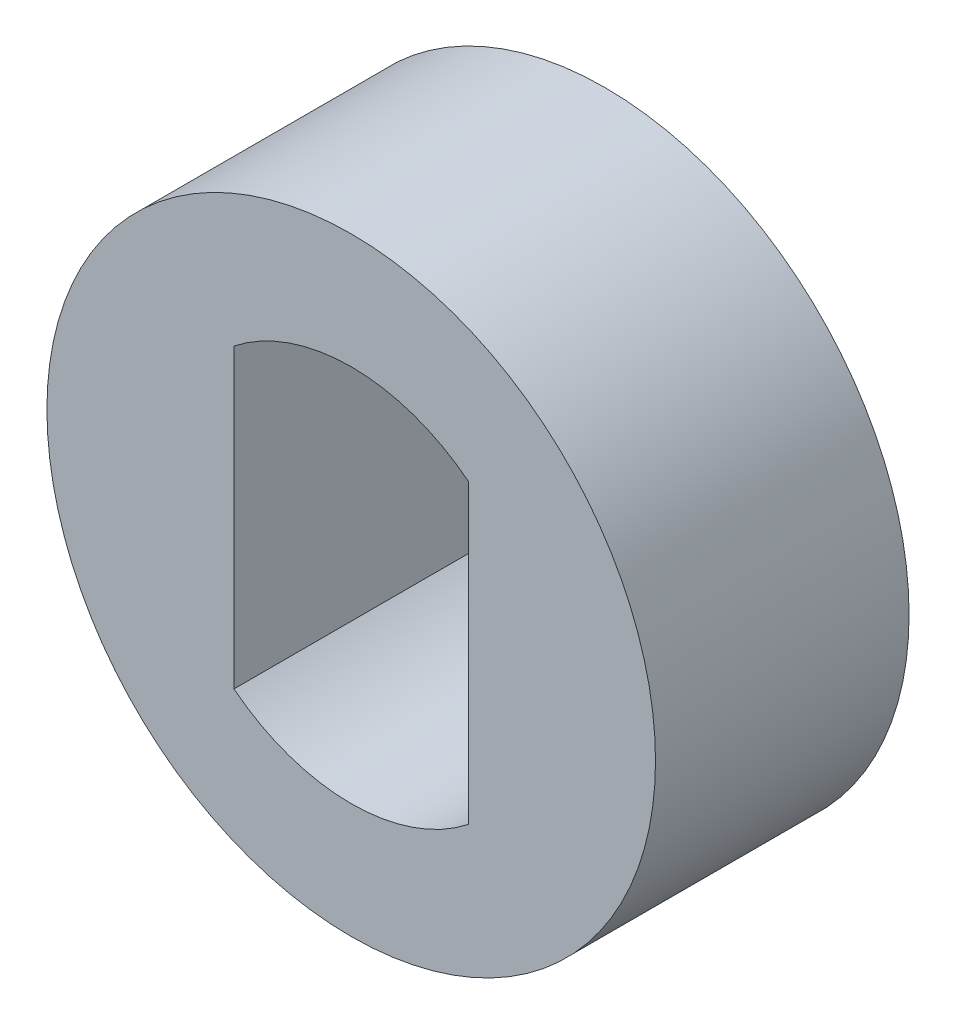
from build123d import *

# Parameters (mm, degrees)
ESQUISSE1_R        = 4.8
BOSS_EXTRU_1_DEPTH = 4


with BuildPart() as part:
    # Esquisse1 → Boss.-Extru.1 (new body)
    with BuildSketch(Plane.XY):
        Circle(ESQUISSE1_R)
        with BuildLine():
            Line((1.85, 2.342109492), (1.85, -2.342109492))
            ThreePointArc((1.85, -2.342109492), (0, -2.984623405), (-1.85, -2.342109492))
            Line((-1.85, -2.342109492), (-1.85, 2.342109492))
            ThreePointArc((-1.85, 2.342109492), (0, 2.984623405), (1.85, 2.342109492))
        make_face(mode=Mode.SUBTRACT)
    extrude(amount=BOSS_EXTRU_1_DEPTH)


solid = part.part
